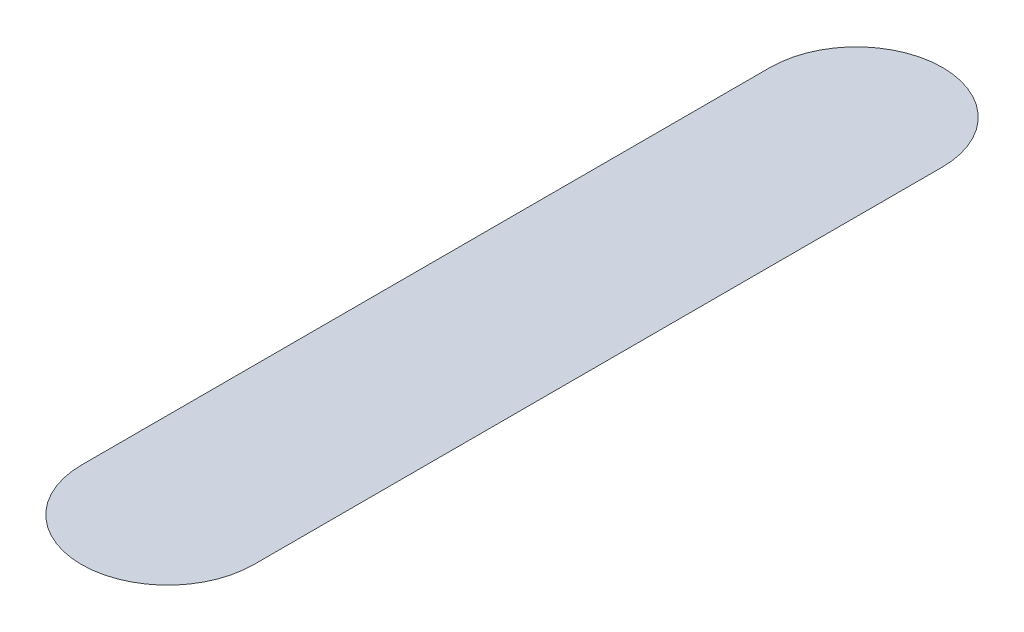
ISO-10303-21;
HEADER;
FILE_DESCRIPTION(('STEP AP214'),'2;1');
FILE_NAME('part.step','',(''),(''),'','','');
FILE_SCHEMA(('AUTOMOTIVE_DESIGN { 1 0 10303 214 1 1 1 1 }'));
ENDSEC;
DATA;
#1=APPLICATION_CONTEXT('core data for automotive mechanical design processes');
#2=APPLICATION_PROTOCOL_DEFINITION('international standard','automotive_design',2000,#1);
#3=PRODUCT_CONTEXT('',#1,'mechanical');
#4=PRODUCT('Part','Part','',(#3));
#5=PRODUCT_RELATED_PRODUCT_CATEGORY('part','',(#4));
#6=PRODUCT_DEFINITION_FORMATION('','',#4);
#7=PRODUCT_DEFINITION_CONTEXT('part definition',#1,'design');
#8=PRODUCT_DEFINITION('design','',#6,#7);
#9=PRODUCT_DEFINITION_SHAPE('','',#8);
#10=(LENGTH_UNIT() NAMED_UNIT(*) SI_UNIT(.MILLI.,.METRE.));
#11=(NAMED_UNIT(*) PLANE_ANGLE_UNIT() SI_UNIT($,.RADIAN.));
#12=(NAMED_UNIT(*) SI_UNIT($,.STERADIAN.) SOLID_ANGLE_UNIT());
#13=UNCERTAINTY_MEASURE_WITH_UNIT(LENGTH_MEASURE(1.E-05),#10,'distance_accuracy_value','');
#14=(GEOMETRIC_REPRESENTATION_CONTEXT(3) GLOBAL_UNCERTAINTY_ASSIGNED_CONTEXT((#13)) GLOBAL_UNIT_ASSIGNED_CONTEXT((#10,
#11,#12)) REPRESENTATION_CONTEXT('',''));
#15=CARTESIAN_POINT('',(0.,0.,0.));
#16=DIRECTION('',(0.,0.,1.));
#17=DIRECTION('',(1.,0.,0.));
#18=AXIS2_PLACEMENT_3D('',#15,#16,#17);
#19=CARTESIAN_POINT('',(0.,0.134937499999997,10.8836098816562));
#20=DIRECTION('',(0.,0.,-1.));
#21=DIRECTION('',(-1.,0.,0.));
#22=AXIS2_PLACEMENT_3D('',#19,#20,#21);
#23=CYLINDRICAL_SURFACE('',#22,1.1509375);
#24=CARTESIAN_POINT('',(0.,0.134937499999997,-8.382));
#25=DIRECTION('',(0.,0.,1.));
#26=DIRECTION('',(1.,0.,0.));
#27=AXIS2_PLACEMENT_3D('',#24,#25,#26);
#28=CIRCLE('',#27,1.1509375);
#29=CARTESIAN_POINT('',(-0.902865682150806,-0.578848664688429,-8.382));
#30=VERTEX_POINT('',#29);
#31=CARTESIAN_POINT('',(0.902865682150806,-0.578848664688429,-8.382));
#32=VERTEX_POINT('',#31);
#33=EDGE_CURVE('E115',#30,#32,#28,.T.);
#34=ORIENTED_EDGE('',*,*,#33,.T.);
#35=DIRECTION('',(0.,0.,-1.));
#36=VECTOR('',#35,1.);
#37=CARTESIAN_POINT('',(0.902865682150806,-0.578848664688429,10.8836098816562));
#38=LINE('',#37,#36);
#39=CARTESIAN_POINT('',(0.902865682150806,-0.578848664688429,8.382));
#40=VERTEX_POINT('',#39);
#41=EDGE_CURVE('E96',#32,#40,#38,.F.);
#42=ORIENTED_EDGE('',*,*,#41,.T.);
#43=CARTESIAN_POINT('',(0.,0.134937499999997,8.382));
#44=DIRECTION('',(0.,0.,1.));
#45=DIRECTION('',(1.,0.,0.));
#46=AXIS2_PLACEMENT_3D('',#43,#44,#45);
#47=CIRCLE('',#46,1.1509375);
#48=CARTESIAN_POINT('',(-0.902865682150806,-0.578848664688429,8.382));
#49=VERTEX_POINT('',#48);
#50=EDGE_CURVE('E107',#49,#40,#47,.T.);
#51=ORIENTED_EDGE('',*,*,#50,.F.);
#52=DIRECTION('',(0.,0.,-1.));
#53=VECTOR('',#52,1.);
#54=CARTESIAN_POINT('',(-0.902865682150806,-0.578848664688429,10.8836098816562));
#55=LINE('',#54,#53);
#56=EDGE_CURVE('E60',#49,#30,#55,.T.);
#57=ORIENTED_EDGE('',*,*,#56,.T.);
#58=EDGE_LOOP('',(#34,#42,#51,#57));
#59=FACE_BOUND('',#58,.T.);
#60=ADVANCED_FACE('F39',(#59),#23,.T.);
#61=CARTESIAN_POINT('',(0.,0.134937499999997,8.382));
#62=DIRECTION('',(0.,-1.,0.));
#63=DIRECTION('',(1.,0.,0.));
#64=AXIS2_PLACEMENT_3D('',#61,#62,#63);
#65=SPHERICAL_SURFACE('',#64,1.1509375);
#66=ORIENTED_EDGE('',*,*,#50,.T.);
#67=CARTESIAN_POINT('',(0.,-0.578848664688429,8.382));
#68=DIRECTION('',(0.,1.,0.));
#69=DIRECTION('',(0.,0.,1.));
#70=AXIS2_PLACEMENT_3D('',#67,#68,#69);
#71=CIRCLE('',#70,0.902865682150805);
#72=EDGE_CURVE('E48',#40,#49,#71,.F.);
#73=ORIENTED_EDGE('',*,*,#72,.T.);
#74=EDGE_LOOP('',(#66,#73));
#75=FACE_BOUND('',#74,.T.);
#76=ADVANCED_FACE('F122',(#75),#65,.T.);
#77=CARTESIAN_POINT('',(0.,0.134937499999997,-8.382));
#78=DIRECTION('',(0.,1.,0.));
#79=DIRECTION('',(1.,0.,0.));
#80=AXIS2_PLACEMENT_3D('',#77,#78,#79);
#81=SPHERICAL_SURFACE('',#80,1.1509375);
#82=ORIENTED_EDGE('',*,*,#33,.F.);
#83=CARTESIAN_POINT('',(0.,-0.578848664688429,-8.382));
#84=DIRECTION('',(0.,1.,0.));
#85=DIRECTION('',(0.,0.,1.));
#86=AXIS2_PLACEMENT_3D('',#83,#84,#85);
#87=CIRCLE('',#86,0.902865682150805);
#88=EDGE_CURVE('E12',#30,#32,#87,.F.);
#89=ORIENTED_EDGE('',*,*,#88,.T.);
#90=EDGE_LOOP('',(#82,#89));
#91=FACE_BOUND('',#90,.T.);
#92=ADVANCED_FACE('F131',(#91),#81,.T.);
#93=CARTESIAN_POINT('',(-2.09838437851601,-1.524,10.8836098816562));
#94=DIRECTION('',(0.,0.,-1.));
#95=DIRECTION('',(-1.,0.,0.));
#96=AXIS2_PLACEMENT_3D('',#93,#94,#95);
#97=CYLINDRICAL_SURFACE('',#96,1.524);
#98=CARTESIAN_POINT('',(-2.09838437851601,-1.524,-8.382));
#99=DIRECTION('',(0.,0.,1.));
#100=DIRECTION('',(1.,0.,0.));
#101=AXIS2_PLACEMENT_3D('',#98,#99,#100);
#102=CIRCLE('',#101,1.524);
#103=CARTESIAN_POINT('',(-2.09838437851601,0.,-8.382));
#104=VERTEX_POINT('',#103);
#105=EDGE_CURVE('E103',#30,#104,#102,.T.);
#106=ORIENTED_EDGE('',*,*,#105,.F.);
#107=ORIENTED_EDGE('',*,*,#56,.F.);
#108=CARTESIAN_POINT('',(-2.09838437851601,-1.524,8.382));
#109=DIRECTION('',(0.,0.,-1.));
#110=DIRECTION('',(-1.,0.,0.));
#111=AXIS2_PLACEMENT_3D('',#108,#109,#110);
#112=CIRCLE('',#111,1.524);
#113=CARTESIAN_POINT('',(-2.09838437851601,0.,8.382));
#114=VERTEX_POINT('',#113);
#115=EDGE_CURVE('E43',#114,#49,#112,.T.);
#116=ORIENTED_EDGE('',*,*,#115,.F.);
#117=DIRECTION('',(0.,0.,-1.));
#118=VECTOR('',#117,1.);
#119=CARTESIAN_POINT('',(-2.09838437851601,0.,101.6));
#120=LINE('',#119,#118);
#121=EDGE_CURVE('E104',#104,#114,#120,.F.);
#122=ORIENTED_EDGE('',*,*,#121,.F.);
#123=EDGE_LOOP('',(#106,#107,#116,#122));
#124=FACE_BOUND('',#123,.T.);
#125=ADVANCED_FACE('F41',(#124),#97,.F.);
#126=CARTESIAN_POINT('',(0.,-1.524,8.382));
#127=DIRECTION('',(0.,-1.,0.));
#128=DIRECTION('',(0.,0.,-1.));
#129=AXIS2_PLACEMENT_3D('',#126,#127,#128);
#130=TOROIDAL_SURFACE('',#129,2.09838437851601,1.524);
#131=ORIENTED_EDGE('',*,*,#115,.T.);
#132=ORIENTED_EDGE('',*,*,#72,.F.);
#133=CARTESIAN_POINT('',(2.09838437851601,-1.524,8.382));
#134=DIRECTION('',(0.,0.,1.));
#135=DIRECTION('',(1.,0.,0.));
#136=AXIS2_PLACEMENT_3D('',#133,#134,#135);
#137=CIRCLE('',#136,1.524);
#138=CARTESIAN_POINT('',(2.09838437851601,0.,8.382));
#139=VERTEX_POINT('',#138);
#140=EDGE_CURVE('E98',#139,#40,#137,.T.);
#141=ORIENTED_EDGE('',*,*,#140,.F.);
#142=CARTESIAN_POINT('',(0.,0.,8.382));
#143=DIRECTION('',(0.,-1.,0.));
#144=DIRECTION('',(0.,0.,-1.));
#145=AXIS2_PLACEMENT_3D('',#142,#143,#144);
#146=CIRCLE('',#145,2.09838437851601);
#147=EDGE_CURVE('E87',#114,#139,#146,.F.);
#148=ORIENTED_EDGE('',*,*,#147,.F.);
#149=EDGE_LOOP('',(#131,#132,#141,#148));
#150=FACE_BOUND('',#149,.T.);
#151=ADVANCED_FACE('F124',(#150),#130,.F.);
#152=CARTESIAN_POINT('',(0.,-1.524,-8.382));
#153=DIRECTION('',(0.,-1.,0.));
#154=DIRECTION('',(0.,0.,-1.));
#155=AXIS2_PLACEMENT_3D('',#152,#153,#154);
#156=TOROIDAL_SURFACE('',#155,2.09838437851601,1.524);
#157=ORIENTED_EDGE('',*,*,#105,.T.);
#158=CARTESIAN_POINT('',(0.,0.,-8.382));
#159=DIRECTION('',(0.,-1.,0.));
#160=DIRECTION('',(0.,0.,-1.));
#161=AXIS2_PLACEMENT_3D('',#158,#159,#160);
#162=CIRCLE('',#161,2.09838437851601);
#163=CARTESIAN_POINT('',(2.09838437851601,0.,-8.382));
#164=VERTEX_POINT('',#163);
#165=EDGE_CURVE('E84',#164,#104,#162,.F.);
#166=ORIENTED_EDGE('',*,*,#165,.F.);
#167=CARTESIAN_POINT('',(2.09838437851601,-1.524,-8.382));
#168=DIRECTION('',(0.,0.,-1.));
#169=DIRECTION('',(-1.,0.,0.));
#170=AXIS2_PLACEMENT_3D('',#167,#168,#169);
#171=CIRCLE('',#170,1.524);
#172=EDGE_CURVE('E93',#32,#164,#171,.T.);
#173=ORIENTED_EDGE('',*,*,#172,.F.);
#174=ORIENTED_EDGE('',*,*,#88,.F.);
#175=EDGE_LOOP('',(#157,#166,#173,#174));
#176=FACE_BOUND('',#175,.T.);
#177=ADVANCED_FACE('F101',(#176),#156,.F.);
#178=CARTESIAN_POINT('',(2.09838437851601,-1.524,10.8836098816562));
#179=DIRECTION('',(0.,0.,-1.));
#180=DIRECTION('',(-1.,0.,0.));
#181=AXIS2_PLACEMENT_3D('',#178,#179,#180);
#182=CYLINDRICAL_SURFACE('',#181,1.524);
#183=ORIENTED_EDGE('',*,*,#140,.T.);
#184=ORIENTED_EDGE('',*,*,#41,.F.);
#185=ORIENTED_EDGE('',*,*,#172,.T.);
#186=DIRECTION('',(0.,0.,-1.));
#187=VECTOR('',#186,1.);
#188=CARTESIAN_POINT('',(2.09838437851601,0.,101.6));
#189=LINE('',#188,#187);
#190=EDGE_CURVE('E80',#139,#164,#189,.T.);
#191=ORIENTED_EDGE('',*,*,#190,.F.);
#192=EDGE_LOOP('',(#183,#184,#185,#191));
#193=FACE_BOUND('',#192,.T.);
#194=ADVANCED_FACE('F94',(#193),#182,.F.);
#195=CARTESIAN_POINT('',(25.,0.,-101.6));
#196=DIRECTION('',(0.,-1.,0.));
#197=DIRECTION('',(0.,0.,-1.));
#198=AXIS2_PLACEMENT_3D('',#195,#196,#197);
#199=PLANE('',#198);
#200=ORIENTED_EDGE('',*,*,#121,.T.);
#201=ORIENTED_EDGE('',*,*,#147,.T.);
#202=ORIENTED_EDGE('',*,*,#190,.T.);
#203=ORIENTED_EDGE('',*,*,#165,.T.);
#204=EDGE_LOOP('',(#200,#201,#202,#203));
#205=FACE_BOUND('',#204,.T.);
#206=ADVANCED_FACE('F82',(#205),#199,.F.);
#207=CLOSED_SHELL('',(#60,#76,#92,#125,#151,#177,#194,#206));
#208=MANIFOLD_SOLID_BREP('B2',#207);
#209=ADVANCED_BREP_SHAPE_REPRESENTATION('',(#18,#208),#14);
#210=SHAPE_DEFINITION_REPRESENTATION(#9,#209);
ENDSEC;
END-ISO-10303-21;
